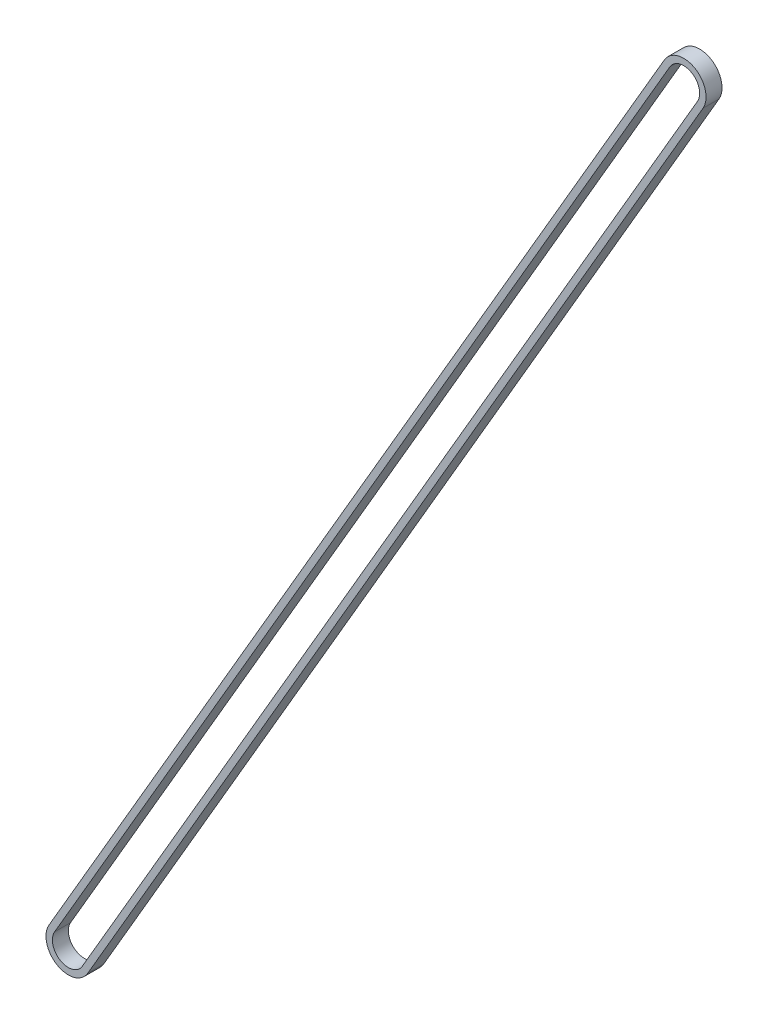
ISO-10303-21;
HEADER;
FILE_DESCRIPTION(('STEP AP214'),'2;1');
FILE_NAME('part.step','',(''),(''),'','','');
FILE_SCHEMA(('AUTOMOTIVE_DESIGN { 1 0 10303 214 1 1 1 1 }'));
ENDSEC;
DATA;
#1=APPLICATION_CONTEXT('core data for automotive mechanical design processes');
#2=APPLICATION_PROTOCOL_DEFINITION('international standard','automotive_design',2000,#1);
#3=PRODUCT_CONTEXT('',#1,'mechanical');
#4=PRODUCT('Part','Part','',(#3));
#5=PRODUCT_RELATED_PRODUCT_CATEGORY('part','',(#4));
#6=PRODUCT_DEFINITION_FORMATION('','',#4);
#7=PRODUCT_DEFINITION_CONTEXT('part definition',#1,'design');
#8=PRODUCT_DEFINITION('design','',#6,#7);
#9=PRODUCT_DEFINITION_SHAPE('','',#8);
#10=(LENGTH_UNIT() NAMED_UNIT(*) SI_UNIT(.MILLI.,.METRE.));
#11=(NAMED_UNIT(*) PLANE_ANGLE_UNIT() SI_UNIT($,.RADIAN.));
#12=(NAMED_UNIT(*) SI_UNIT($,.STERADIAN.) SOLID_ANGLE_UNIT());
#13=UNCERTAINTY_MEASURE_WITH_UNIT(LENGTH_MEASURE(1.E-05),#10,'distance_accuracy_value','');
#14=(GEOMETRIC_REPRESENTATION_CONTEXT(3) GLOBAL_UNCERTAINTY_ASSIGNED_CONTEXT((#13)) GLOBAL_UNIT_ASSIGNED_CONTEXT((#10,
#11,#12)) REPRESENTATION_CONTEXT('',''));
#15=CARTESIAN_POINT('',(0.,0.,0.));
#16=DIRECTION('',(0.,0.,1.));
#17=DIRECTION('',(1.,0.,0.));
#18=AXIS2_PLACEMENT_3D('',#15,#16,#17);
#19=CARTESIAN_POINT('',(-175.771315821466,-289.988208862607,5.));
#20=DIRECTION('',(-0.864190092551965,0.503165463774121,0.));
#21=DIRECTION('',(-0.503165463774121,-0.864190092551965,0.));
#22=AXIS2_PLACEMENT_3D('',#19,#20,#21);
#23=PLANE('',#22);
#24=DIRECTION('',(0.,0.,-1.));
#25=VECTOR('',#24,1.);
#26=CARTESIAN_POINT('',(16.7780251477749,40.716588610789,5.));
#27=LINE('',#26,#25);
#28=CARTESIAN_POINT('',(16.7780251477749,40.716588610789,5.));
#29=VERTEX_POINT('',#28);
#30=CARTESIAN_POINT('',(16.778025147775,40.716588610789,0.));
#31=VERTEX_POINT('',#30);
#32=EDGE_CURVE('E105',#29,#31,#27,.T.);
#33=ORIENTED_EDGE('',*,*,#32,.F.);
#34=DIRECTION('',(0.503165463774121,0.864190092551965,0.));
#35=VECTOR('',#34,1.);
#36=CARTESIAN_POINT('',(-175.771315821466,-289.988208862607,5.));
#37=LINE('',#36,#35);
#38=CARTESIAN_POINT('',(-175.771315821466,-289.988208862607,5.));
#39=VERTEX_POINT('',#38);
#40=EDGE_CURVE('E76',#39,#29,#37,.T.);
#41=ORIENTED_EDGE('',*,*,#40,.F.);
#42=DIRECTION('',(0.,0.,1.));
#43=VECTOR('',#42,1.);
#44=CARTESIAN_POINT('',(-175.771315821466,-289.988208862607,5.));
#45=LINE('',#44,#43);
#46=CARTESIAN_POINT('',(-175.771315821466,-289.988208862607,0.));
#47=VERTEX_POINT('',#46);
#48=EDGE_CURVE('E118',#47,#39,#45,.T.);
#49=ORIENTED_EDGE('',*,*,#48,.F.);
#50=DIRECTION('',(0.503165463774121,0.864190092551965,0.));
#51=VECTOR('',#50,1.);
#52=CARTESIAN_POINT('',(-175.771315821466,-289.988208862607,0.));
#53=LINE('',#52,#51);
#54=EDGE_CURVE('E128',#47,#31,#53,.T.);
#55=ORIENTED_EDGE('',*,*,#54,.T.);
#56=EDGE_LOOP('',(#33,#41,#49,#55));
#57=FACE_BOUND('',#56,.T.);
#58=ADVANCED_FACE('F17',(#57),#23,.F.);
#59=CARTESIAN_POINT('',(-186.14159693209,-283.950223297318,5.));
#60=DIRECTION('',(0.864190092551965,-0.503165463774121,0.));
#61=DIRECTION('',(0.503165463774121,0.864190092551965,0.));
#62=AXIS2_PLACEMENT_3D('',#59,#60,#61);
#63=PLANE('',#62);
#64=DIRECTION('',(0.503165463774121,0.864190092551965,0.));
#65=VECTOR('',#64,1.);
#66=CARTESIAN_POINT('',(-186.14159693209,-283.950223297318,5.));
#67=LINE('',#66,#65);
#68=CARTESIAN_POINT('',(-186.14159693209,-283.950223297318,5.));
#69=VERTEX_POINT('',#68);
#70=CARTESIAN_POINT('',(6.40774403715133,46.7545741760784,5.));
#71=VERTEX_POINT('',#70);
#72=EDGE_CURVE('E98',#69,#71,#67,.T.);
#73=ORIENTED_EDGE('',*,*,#72,.F.);
#74=DIRECTION('',(0.,0.,-1.));
#75=VECTOR('',#74,1.);
#76=CARTESIAN_POINT('',(-186.14159693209,-283.950223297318,5.));
#77=LINE('',#76,#75);
#78=CARTESIAN_POINT('',(-186.14159693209,-283.950223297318,0.));
#79=VERTEX_POINT('',#78);
#80=EDGE_CURVE('E106',#69,#79,#77,.T.);
#81=ORIENTED_EDGE('',*,*,#80,.T.);
#82=DIRECTION('',(0.503165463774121,0.864190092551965,0.));
#83=VECTOR('',#82,1.);
#84=CARTESIAN_POINT('',(-186.14159693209,-283.950223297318,0.));
#85=LINE('',#84,#83);
#86=CARTESIAN_POINT('',(6.40774403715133,46.7545741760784,0.));
#87=VERTEX_POINT('',#86);
#88=EDGE_CURVE('E125',#79,#87,#85,.T.);
#89=ORIENTED_EDGE('',*,*,#88,.T.);
#90=DIRECTION('',(0.,0.,-1.));
#91=VECTOR('',#90,1.);
#92=CARTESIAN_POINT('',(6.40774403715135,46.7545741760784,5.));
#93=LINE('',#92,#91);
#94=EDGE_CURVE('E115',#87,#71,#93,.F.);
#95=ORIENTED_EDGE('',*,*,#94,.T.);
#96=EDGE_LOOP('',(#73,#81,#89,#95));
#97=FACE_BOUND('',#96,.T.);
#98=ADVANCED_FACE('F139',(#97),#63,.T.);
#99=CARTESIAN_POINT('',(10.7286944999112,44.2387468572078,5.));
#100=DIRECTION('',(0.,0.,-1.));
#101=DIRECTION('',(-1.,0.,0.));
#102=AXIS2_PLACEMENT_3D('',#99,#100,#101);
#103=CYLINDRICAL_SURFACE('',#102,5.);
#104=DIRECTION('',(0.,0.,1.));
#105=VECTOR('',#104,1.);
#106=CARTESIAN_POINT('',(15.049644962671,41.7229195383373,5.));
#107=LINE('',#106,#105);
#108=CARTESIAN_POINT('',(15.049644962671,41.7229195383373,5.));
#109=VERTEX_POINT('',#108);
#110=CARTESIAN_POINT('',(15.049644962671,41.7229195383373,0.));
#111=VERTEX_POINT('',#110);
#112=EDGE_CURVE('E112',#109,#111,#107,.F.);
#113=ORIENTED_EDGE('',*,*,#112,.F.);
#114=CARTESIAN_POINT('',(10.7286944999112,44.2387468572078,5.));
#115=DIRECTION('',(0.,0.,-1.));
#116=DIRECTION('',(-1.,0.,0.));
#117=AXIS2_PLACEMENT_3D('',#114,#115,#116);
#118=CIRCLE('',#117,5.);
#119=EDGE_CURVE('E100',#71,#109,#118,.T.);
#120=ORIENTED_EDGE('',*,*,#119,.F.);
#121=ORIENTED_EDGE('',*,*,#94,.F.);
#122=CARTESIAN_POINT('',(10.7286944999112,44.2387468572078,0.));
#123=DIRECTION('',(0.,0.,-1.));
#124=DIRECTION('',(-1.,0.,0.));
#125=AXIS2_PLACEMENT_3D('',#122,#123,#124);
#126=CIRCLE('',#125,5.);
#127=EDGE_CURVE('E122',#87,#111,#126,.T.);
#128=ORIENTED_EDGE('',*,*,#127,.T.);
#129=EDGE_LOOP('',(#113,#120,#121,#128));
#130=FACE_BOUND('',#129,.T.);
#131=ADVANCED_FACE('F147',(#130),#103,.F.);
#132=CARTESIAN_POINT('',(-177.49969600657,-288.981877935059,5.));
#133=DIRECTION('',(-0.864190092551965,0.503165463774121,0.));
#134=DIRECTION('',(-0.503165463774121,-0.864190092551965,0.));
#135=AXIS2_PLACEMENT_3D('',#132,#133,#134);
#136=PLANE('',#135);
#137=DIRECTION('',(-0.503165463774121,-0.864190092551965,0.));
#138=VECTOR('',#137,1.);
#139=CARTESIAN_POINT('',(15.049644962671,41.7229195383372,5.));
#140=LINE('',#139,#138);
#141=CARTESIAN_POINT('',(-177.49969600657,-288.981877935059,5.));
#142=VERTEX_POINT('',#141);
#143=EDGE_CURVE('E80',#109,#142,#140,.T.);
#144=ORIENTED_EDGE('',*,*,#143,.F.);
#145=ORIENTED_EDGE('',*,*,#112,.T.);
#146=DIRECTION('',(-0.503165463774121,-0.864190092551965,0.));
#147=VECTOR('',#146,1.);
#148=CARTESIAN_POINT('',(15.049644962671,41.7229195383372,0.));
#149=LINE('',#148,#147);
#150=CARTESIAN_POINT('',(-177.49969600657,-288.981877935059,0.));
#151=VERTEX_POINT('',#150);
#152=EDGE_CURVE('E94',#111,#151,#149,.T.);
#153=ORIENTED_EDGE('',*,*,#152,.T.);
#154=DIRECTION('',(0.,0.,-1.));
#155=VECTOR('',#154,1.);
#156=CARTESIAN_POINT('',(-177.49969600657,-288.981877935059,5.));
#157=LINE('',#156,#155);
#158=EDGE_CURVE('E109',#151,#142,#157,.F.);
#159=ORIENTED_EDGE('',*,*,#158,.T.);
#160=EDGE_LOOP('',(#144,#145,#153,#159));
#161=FACE_BOUND('',#160,.T.);
#162=ADVANCED_FACE('F149',(#161),#136,.T.);
#163=CARTESIAN_POINT('',(-181.82064646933,-286.466050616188,5.));
#164=DIRECTION('',(0.,0.,-1.));
#165=DIRECTION('',(-1.,0.,0.));
#166=AXIS2_PLACEMENT_3D('',#163,#164,#165);
#167=CYLINDRICAL_SURFACE('',#166,5.);
#168=CARTESIAN_POINT('',(-181.82064646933,-286.466050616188,5.));
#169=DIRECTION('',(0.,0.,-1.));
#170=DIRECTION('',(-1.,0.,0.));
#171=AXIS2_PLACEMENT_3D('',#168,#169,#170);
#172=CIRCLE('',#171,5.);
#173=EDGE_CURVE('E101',#142,#69,#172,.T.);
#174=ORIENTED_EDGE('',*,*,#173,.F.);
#175=ORIENTED_EDGE('',*,*,#158,.F.);
#176=CARTESIAN_POINT('',(-181.82064646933,-286.466050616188,0.));
#177=DIRECTION('',(0.,0.,-1.));
#178=DIRECTION('',(-1.,0.,0.));
#179=AXIS2_PLACEMENT_3D('',#176,#177,#178);
#180=CIRCLE('',#179,5.);
#181=EDGE_CURVE('E91',#151,#79,#180,.T.);
#182=ORIENTED_EDGE('',*,*,#181,.T.);
#183=ORIENTED_EDGE('',*,*,#80,.F.);
#184=EDGE_LOOP('',(#174,#175,#182,#183));
#185=FACE_BOUND('',#184,.T.);
#186=ADVANCED_FACE('F152',(#185),#167,.F.);
#187=CARTESIAN_POINT('',(10.7286944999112,44.2387468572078,5.));
#188=DIRECTION('',(0.,0.,-1.));
#189=DIRECTION('',(-1.,0.,0.));
#190=AXIS2_PLACEMENT_3D('',#187,#188,#189);
#191=CYLINDRICAL_SURFACE('',#190,7.00000000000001);
#192=CARTESIAN_POINT('',(10.7286944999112,44.2387468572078,5.));
#193=DIRECTION('',(0.,0.,-1.));
#194=DIRECTION('',(-1.,0.,0.));
#195=AXIS2_PLACEMENT_3D('',#192,#193,#194);
#196=CIRCLE('',#195,7.00000000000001);
#197=CARTESIAN_POINT('',(4.67936385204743,47.7609051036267,5.));
#198=VERTEX_POINT('',#197);
#199=EDGE_CURVE('E20',#29,#198,#196,.F.);
#200=ORIENTED_EDGE('',*,*,#199,.F.);
#201=ORIENTED_EDGE('',*,*,#32,.T.);
#202=CARTESIAN_POINT('',(10.7286944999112,44.2387468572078,0.));
#203=DIRECTION('',(0.,0.,-1.));
#204=DIRECTION('',(-1.,0.,0.));
#205=AXIS2_PLACEMENT_3D('',#202,#203,#204);
#206=CIRCLE('',#205,7.00000000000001);
#207=CARTESIAN_POINT('',(4.67936385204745,47.7609051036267,0.));
#208=VERTEX_POINT('',#207);
#209=EDGE_CURVE('E90',#31,#208,#206,.F.);
#210=ORIENTED_EDGE('',*,*,#209,.T.);
#211=DIRECTION('',(0.,0.,1.));
#212=VECTOR('',#211,1.);
#213=CARTESIAN_POINT('',(4.67936385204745,47.7609051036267,5.));
#214=LINE('',#213,#212);
#215=EDGE_CURVE('E84',#208,#198,#214,.T.);
#216=ORIENTED_EDGE('',*,*,#215,.T.);
#217=EDGE_LOOP('',(#200,#201,#210,#216));
#218=FACE_BOUND('',#217,.T.);
#219=ADVANCED_FACE('F88',(#218),#191,.T.);
#220=CARTESIAN_POINT('',(-181.82064646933,-286.466050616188,5.));
#221=DIRECTION('',(0.,0.,1.));
#222=DIRECTION('',(1.,0.,0.));
#223=AXIS2_PLACEMENT_3D('',#220,#221,#222);
#224=PLANE('',#223);
#225=ORIENTED_EDGE('',*,*,#72,.T.);
#226=ORIENTED_EDGE('',*,*,#119,.T.);
#227=ORIENTED_EDGE('',*,*,#143,.T.);
#228=ORIENTED_EDGE('',*,*,#173,.T.);
#229=EDGE_LOOP('',(#225,#226,#227,#228));
#230=FACE_BOUND('',#229,.T.);
#231=ORIENTED_EDGE('',*,*,#199,.T.);
#232=DIRECTION('',(0.503165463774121,0.864190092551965,0.));
#233=VECTOR('',#232,1.);
#234=CARTESIAN_POINT('',(-187.869977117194,-282.94389236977,5.));
#235=LINE('',#234,#233);
#236=CARTESIAN_POINT('',(-187.869977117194,-282.94389236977,5.));
#237=VERTEX_POINT('',#236);
#238=EDGE_CURVE('E74',#198,#237,#235,.F.);
#239=ORIENTED_EDGE('',*,*,#238,.T.);
#240=CARTESIAN_POINT('',(-181.82064646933,-286.466050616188,5.));
#241=DIRECTION('',(0.,0.,-1.));
#242=DIRECTION('',(-1.,0.,0.));
#243=AXIS2_PLACEMENT_3D('',#240,#241,#242);
#244=CIRCLE('',#243,7.00000000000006);
#245=EDGE_CURVE('E129',#39,#237,#244,.T.);
#246=ORIENTED_EDGE('',*,*,#245,.F.);
#247=ORIENTED_EDGE('',*,*,#40,.T.);
#248=EDGE_LOOP('',(#231,#239,#246,#247));
#249=FACE_BOUND('',#248,.T.);
#250=ADVANCED_FACE('F72',(#230,#249),#224,.T.);
#251=CARTESIAN_POINT('',(-181.82064646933,-286.466050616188,5.));
#252=DIRECTION('',(0.,0.,-1.));
#253=DIRECTION('',(-1.,0.,0.));
#254=AXIS2_PLACEMENT_3D('',#251,#252,#253);
#255=CYLINDRICAL_SURFACE('',#254,7.00000000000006);
#256=DIRECTION('',(0.,0.,1.));
#257=VECTOR('',#256,1.);
#258=CARTESIAN_POINT('',(-187.869977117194,-282.94389236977,5.));
#259=LINE('',#258,#257);
#260=CARTESIAN_POINT('',(-187.869977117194,-282.94389236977,0.));
#261=VERTEX_POINT('',#260);
#262=EDGE_CURVE('E26',#237,#261,#259,.F.);
#263=ORIENTED_EDGE('',*,*,#262,.T.);
#264=CARTESIAN_POINT('',(-181.82064646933,-286.466050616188,0.));
#265=DIRECTION('',(0.,0.,-1.));
#266=DIRECTION('',(-1.,0.,0.));
#267=AXIS2_PLACEMENT_3D('',#264,#265,#266);
#268=CIRCLE('',#267,7.00000000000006);
#269=EDGE_CURVE('E34',#261,#47,#268,.F.);
#270=ORIENTED_EDGE('',*,*,#269,.T.);
#271=ORIENTED_EDGE('',*,*,#48,.T.);
#272=ORIENTED_EDGE('',*,*,#245,.T.);
#273=EDGE_LOOP('',(#263,#270,#271,#272));
#274=FACE_BOUND('',#273,.T.);
#275=ADVANCED_FACE('F163',(#274),#255,.T.);
#276=CARTESIAN_POINT('',(-181.82064646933,-286.466050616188,0.));
#277=DIRECTION('',(0.,0.,1.));
#278=DIRECTION('',(1.,0.,0.));
#279=AXIS2_PLACEMENT_3D('',#276,#277,#278);
#280=PLANE('',#279);
#281=ORIENTED_EDGE('',*,*,#181,.F.);
#282=ORIENTED_EDGE('',*,*,#152,.F.);
#283=ORIENTED_EDGE('',*,*,#127,.F.);
#284=ORIENTED_EDGE('',*,*,#88,.F.);
#285=EDGE_LOOP('',(#281,#282,#283,#284));
#286=FACE_BOUND('',#285,.T.);
#287=DIRECTION('',(0.503165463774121,0.864190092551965,0.));
#288=VECTOR('',#287,1.);
#289=CARTESIAN_POINT('',(-187.869977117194,-282.94389236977,0.));
#290=LINE('',#289,#288);
#291=EDGE_CURVE('E11',#261,#208,#290,.T.);
#292=ORIENTED_EDGE('',*,*,#291,.T.);
#293=ORIENTED_EDGE('',*,*,#209,.F.);
#294=ORIENTED_EDGE('',*,*,#54,.F.);
#295=ORIENTED_EDGE('',*,*,#269,.F.);
#296=EDGE_LOOP('',(#292,#293,#294,#295));
#297=FACE_BOUND('',#296,.T.);
#298=ADVANCED_FACE('F157',(#286,#297),#280,.F.);
#299=CARTESIAN_POINT('',(-187.869977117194,-282.94389236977,5.));
#300=DIRECTION('',(0.864190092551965,-0.503165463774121,0.));
#301=DIRECTION('',(0.503165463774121,0.864190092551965,0.));
#302=AXIS2_PLACEMENT_3D('',#299,#300,#301);
#303=PLANE('',#302);
#304=ORIENTED_EDGE('',*,*,#262,.F.);
#305=ORIENTED_EDGE('',*,*,#238,.F.);
#306=ORIENTED_EDGE('',*,*,#215,.F.);
#307=ORIENTED_EDGE('',*,*,#291,.F.);
#308=EDGE_LOOP('',(#304,#305,#306,#307));
#309=FACE_BOUND('',#308,.T.);
#310=ADVANCED_FACE('F83',(#309),#303,.F.);
#311=CLOSED_SHELL('',(#58,#98,#131,#162,#186,#219,#250,#275,#298,#310));
#312=MANIFOLD_SOLID_BREP('B1',#311);
#313=ADVANCED_BREP_SHAPE_REPRESENTATION('',(#18,#312),#14);
#314=SHAPE_DEFINITION_REPRESENTATION(#9,#313);
ENDSEC;
END-ISO-10303-21;
